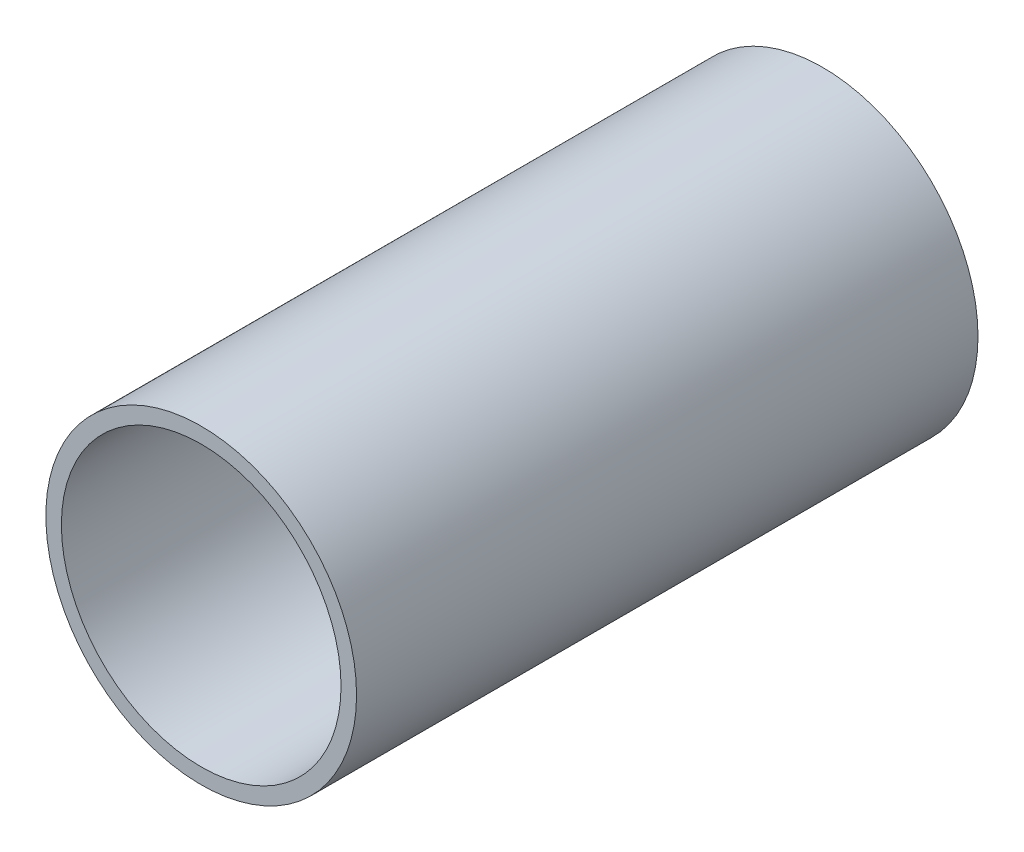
from build123d import *

# Parameters (mm, degrees)
ESQUISSE1_R        = 250
ESQUISSE1_R_2      = 225
BOSS_EXTRU_1_DEPTH = 1000


with BuildPart() as part:
    # Esquisse1 → Boss.-Extru.1 (new body)
    with BuildSketch(Plane.XY):
        Circle(ESQUISSE1_R)
        Circle(ESQUISSE1_R_2, mode=Mode.SUBTRACT)
    extrude(amount=BOSS_EXTRU_1_DEPTH)


solid = part.part
